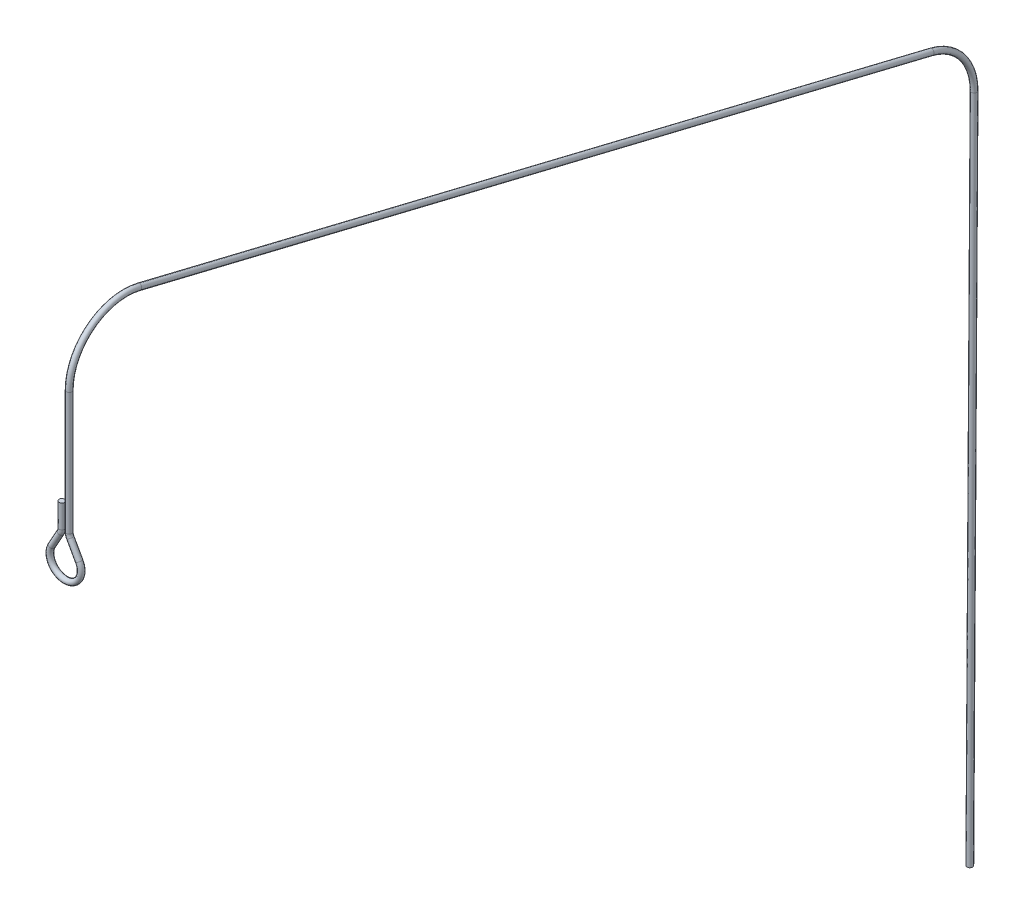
ISO-10303-21;
HEADER;
FILE_DESCRIPTION(('STEP AP214'),'2;1');
FILE_NAME('part.step','',(''),(''),'','','');
FILE_SCHEMA(('AUTOMOTIVE_DESIGN { 1 0 10303 214 1 1 1 1 }'));
ENDSEC;
DATA;
#1=APPLICATION_CONTEXT('core data for automotive mechanical design processes');
#2=APPLICATION_PROTOCOL_DEFINITION('international standard','automotive_design',2000,#1);
#3=PRODUCT_CONTEXT('',#1,'mechanical');
#4=PRODUCT('Part','Part','',(#3));
#5=PRODUCT_RELATED_PRODUCT_CATEGORY('part','',(#4));
#6=PRODUCT_DEFINITION_FORMATION('','',#4);
#7=PRODUCT_DEFINITION_CONTEXT('part definition',#1,'design');
#8=PRODUCT_DEFINITION('design','',#6,#7);
#9=PRODUCT_DEFINITION_SHAPE('','',#8);
#10=(LENGTH_UNIT() NAMED_UNIT(*) SI_UNIT(.MILLI.,.METRE.));
#11=(NAMED_UNIT(*) PLANE_ANGLE_UNIT() SI_UNIT($,.RADIAN.));
#12=(NAMED_UNIT(*) SI_UNIT($,.STERADIAN.) SOLID_ANGLE_UNIT());
#13=UNCERTAINTY_MEASURE_WITH_UNIT(LENGTH_MEASURE(1.E-05),#10,'distance_accuracy_value','');
#14=(GEOMETRIC_REPRESENTATION_CONTEXT(3) GLOBAL_UNCERTAINTY_ASSIGNED_CONTEXT((#13)) GLOBAL_UNIT_ASSIGNED_CONTEXT((#10,
#11,#12)) REPRESENTATION_CONTEXT('',''));
#15=CARTESIAN_POINT('',(0.,0.,0.));
#16=DIRECTION('',(0.,0.,1.));
#17=DIRECTION('',(1.,0.,0.));
#18=AXIS2_PLACEMENT_3D('',#15,#16,#17);
#19=CARTESIAN_POINT('',(0.,1960.39642575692,-7.81948440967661));
#20=DIRECTION('',(0.,-0.999979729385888,0.00636716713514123));
#21=DIRECTION('',(0.,-0.00636716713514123,-0.999979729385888));
#22=AXIS2_PLACEMENT_3D('',#19,#20,#21);
#23=CYLINDRICAL_SURFACE('',#22,2.5);
#24=CARTESIAN_POINT('',(0.,1960.39642575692,-7.81948440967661));
#25=DIRECTION('',(0.,-0.999979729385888,0.00636716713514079));
#26=DIRECTION('',(0.,-0.00636716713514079,-0.999979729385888));
#27=AXIS2_PLACEMENT_3D('',#24,#25,#26);
#28=CIRCLE('',#27,2.5);
#29=CARTESIAN_POINT('',(0.,1960.38050783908,-10.3194337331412));
#30=VERTEX_POINT('',#29);
#31=EDGE_CURVE('E37',#30,#30,#28,.T.);
#32=ORIENTED_EDGE('',*,*,#31,.T.);
#33=EDGE_LOOP('',(#32));
#34=FACE_BOUND('',#33,.T.);
#35=CARTESIAN_POINT('',(0.,1360.39642575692,-3.9991066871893));
#36=DIRECTION('',(0.,-0.999979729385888,0.00636716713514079));
#37=DIRECTION('',(0.,-0.00636716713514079,-0.999979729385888));
#38=AXIS2_PLACEMENT_3D('',#35,#36,#37);
#39=CIRCLE('',#38,2.5);
#40=CARTESIAN_POINT('',(0.,1360.38050783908,-6.49905601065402));
#41=VERTEX_POINT('',#40);
#42=EDGE_CURVE('E10',#41,#41,#39,.T.);
#43=ORIENTED_EDGE('',*,*,#42,.F.);
#44=EDGE_LOOP('',(#43));
#45=FACE_BOUND('',#44,.T.);
#46=ADVANCED_FACE('F31',(#34,#45),#23,.T.);
#47=CARTESIAN_POINT('',(0.,1960.71796769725,42.6794919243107));
#48=DIRECTION('',(-1.,0.,0.));
#49=DIRECTION('',(0.,0.,1.));
#50=AXIS2_PLACEMENT_3D('',#47,#48,#49);
#51=TOROIDAL_SURFACE('',#50,50.4999999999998,2.5);
#52=CARTESIAN_POINT('',(0.,2009.78698008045,30.7429085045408));
#53=DIRECTION('',(0.,-0.2363679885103,-0.971663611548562));
#54=DIRECTION('',(0.,0.971663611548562,-0.2363679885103));
#55=AXIS2_PLACEMENT_3D('',#52,#53,#54);
#56=CIRCLE('',#55,2.5);
#57=CARTESIAN_POINT('',(0.,2012.21613910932,30.151988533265));
#58=VERTEX_POINT('',#57);
#59=EDGE_CURVE('E41',#58,#58,#56,.T.);
#60=CARTESIAN_POINT('',(0.,1960.71796769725,42.6794919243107));
#61=DIRECTION('',(-1.,0.,0.));
#62=DIRECTION('',(0.,0.,1.));
#63=AXIS2_PLACEMENT_3D('',#60,#61,#62);
#64=CIRCLE('',#63,52.9999999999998);
#65=EDGE_CURVE('',#58,#30,#64,.T.);
#66=ORIENTED_EDGE('',*,*,#59,.T.);
#67=ORIENTED_EDGE('',*,*,#31,.F.);
#68=ORIENTED_EDGE('',*,*,#65,.T.);
#69=ORIENTED_EDGE('',*,*,#65,.F.);
#70=EDGE_LOOP('',(#66,#68,#67,#69));
#71=FACE_BOUND('',#70,.T.);
#72=ADVANCED_FACE('F120',(#71),#51,.T.);
#73=CARTESIAN_POINT('',(0.,2182.68063146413,741.475655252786));
#74=DIRECTION('',(0.,-0.2363679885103,-0.971663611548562));
#75=DIRECTION('',(0.,0.971663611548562,-0.2363679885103));
#76=AXIS2_PLACEMENT_3D('',#73,#74,#75);
#77=CYLINDRICAL_SURFACE('',#76,2.5);
#78=CARTESIAN_POINT('',(0.,2182.68063146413,741.475655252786));
#79=DIRECTION('',(0.,-0.2363679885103,-0.971663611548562));
#80=DIRECTION('',(0.,0.971663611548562,-0.2363679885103));
#81=AXIS2_PLACEMENT_3D('',#78,#79,#80);
#82=CIRCLE('',#81,2.5);
#83=CARTESIAN_POINT('',(0.,2185.109790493,740.88473528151));
#84=VERTEX_POINT('',#83);
#85=EDGE_CURVE('E45',#84,#84,#82,.T.);
#86=CARTESIAN_POINT('',(0.,2185.109790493,740.88473528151));
#87=CARTESIAN_POINT('',(0.,2183.30881495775,733.481269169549));
#88=CARTESIAN_POINT('',(0.,2181.5078394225,726.077803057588));
#89=CARTESIAN_POINT('',(0.,2177.90588835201,711.270870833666));
#90=CARTESIAN_POINT('',(0.,2176.10491281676,703.867404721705));
#91=CARTESIAN_POINT('',(0.,2172.50296174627,689.060472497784));
#92=CARTESIAN_POINT('',(0.,2170.70198621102,681.657006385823));
#93=CARTESIAN_POINT('',(0.,2167.10003514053,666.850074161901));
#94=CARTESIAN_POINT('',(0.,2165.29905960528,659.44660804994));
#95=CARTESIAN_POINT('',(0.,2161.69710853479,644.639675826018));
#96=CARTESIAN_POINT('',(0.,2159.89613299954,637.236209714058));
#97=CARTESIAN_POINT('',(0.,2156.29418192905,622.429277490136));
#98=CARTESIAN_POINT('',(0.,2154.4932063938,615.025811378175));
#99=CARTESIAN_POINT('',(0.,2150.89125532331,600.218879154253));
#100=CARTESIAN_POINT('',(0.,2149.09027978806,592.815413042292));
#101=CARTESIAN_POINT('',(0.,2145.48832871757,578.008480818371));
#102=CARTESIAN_POINT('',(0.,2143.68735318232,570.60501470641));
#103=CARTESIAN_POINT('',(0.,2140.08540211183,555.798082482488));
#104=CARTESIAN_POINT('',(0.,2138.28442657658,548.394616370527));
#105=CARTESIAN_POINT('',(0.,2134.68247550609,533.587684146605));
#106=CARTESIAN_POINT('',(0.,2132.88149997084,526.184218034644));
#107=CARTESIAN_POINT('',(0.,2129.27954890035,511.377285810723));
#108=CARTESIAN_POINT('',(0.,2127.4785733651,503.973819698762));
#109=CARTESIAN_POINT('',(0.,2123.87662229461,489.16688747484));
#110=CARTESIAN_POINT('',(0.,2122.07564675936,481.763421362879));
#111=CARTESIAN_POINT('',(0.,2118.47369568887,466.956489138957));
#112=CARTESIAN_POINT('',(0.,2116.67272015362,459.553023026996));
#113=CARTESIAN_POINT('',(0.,2113.07076908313,444.746090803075));
#114=CARTESIAN_POINT('',(0.,2111.26979354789,437.342624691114));
#115=CARTESIAN_POINT('',(0.,2107.66784247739,422.535692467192));
#116=CARTESIAN_POINT('',(0.,2105.86686694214,415.132226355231));
#117=CARTESIAN_POINT('',(0.,2102.26491587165,400.325294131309));
#118=CARTESIAN_POINT('',(0.,2100.4639403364,392.921828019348));
#119=CARTESIAN_POINT('',(0.,2096.86198926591,378.114895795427));
#120=CARTESIAN_POINT('',(0.,2095.06101373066,370.711429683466));
#121=CARTESIAN_POINT('',(0.,2091.45906266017,355.904497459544));
#122=CARTESIAN_POINT('',(0.,2089.65808712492,348.501031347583));
#123=CARTESIAN_POINT('',(0.,2086.05613605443,333.694099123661));
#124=CARTESIAN_POINT('',(0.,2084.25516051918,326.2906330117));
#125=CARTESIAN_POINT('',(0.,2080.65320944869,311.483700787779));
#126=CARTESIAN_POINT('',(0.,2078.85223391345,304.080234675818));
#127=CARTESIAN_POINT('',(0.,2075.25028284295,289.273302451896));
#128=CARTESIAN_POINT('',(0.,2073.4493073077,281.869836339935));
#129=CARTESIAN_POINT('',(0.,2069.84735623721,267.062904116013));
#130=CARTESIAN_POINT('',(0.,2068.04638070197,259.659438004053));
#131=CARTESIAN_POINT('',(0.,2064.44442963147,244.852505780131));
#132=CARTESIAN_POINT('',(0.,2062.64345409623,237.44903966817));
#133=CARTESIAN_POINT('',(0.,2059.04150302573,222.642107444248));
#134=CARTESIAN_POINT('',(0.,2057.24052749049,215.238641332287));
#135=CARTESIAN_POINT('',(0.,2053.63857641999,200.431709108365));
#136=CARTESIAN_POINT('',(0.,2051.83760088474,193.028242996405));
#137=CARTESIAN_POINT('',(0.,2048.23564981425,178.221310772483));
#138=CARTESIAN_POINT('',(0.,2046.43467427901,170.817844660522));
#139=CARTESIAN_POINT('',(0.,2042.83272320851,156.0109124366));
#140=CARTESIAN_POINT('',(0.,2041.03174767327,148.607446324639));
#141=CARTESIAN_POINT('',(0.,2037.42979660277,133.800514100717));
#142=CARTESIAN_POINT('',(0.,2035.62882106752,126.397047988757));
#143=CARTESIAN_POINT('',(0.,2032.02686999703,111.590115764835));
#144=CARTESIAN_POINT('',(0.,2030.22589446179,104.186649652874));
#145=CARTESIAN_POINT('',(0.,2026.62394339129,89.3797174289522));
#146=CARTESIAN_POINT('',(0.,2024.82296785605,81.9762513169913));
#147=CARTESIAN_POINT('',(0.,2021.22101678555,67.1693190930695));
#148=CARTESIAN_POINT('',(0.,2019.42004125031,59.7658529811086));
#149=CARTESIAN_POINT('',(0.,2015.81809017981,44.9589207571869));
#150=CARTESIAN_POINT('',(0.,2014.01711464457,37.555454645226));
#151=CARTESIAN_POINT('',(0.,2012.21613910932,30.1519885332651));
#152=B_SPLINE_CURVE_WITH_KNOTS('',3,(#86,#87,#88,#89,#90,#91,#92,#93,#94,#95,#96,#97,#98,#99,
#100,#101,#102,#103,#104,#105,#106,#107,#108,#109,#110,#111,#112,#113,#114,#115,#116,#117,#118,
#119,#120,#121,#122,#123,#124,#125,#126,#127,#128,#129,#130,#131,#132,#133,#134,#135,#136,#137,
#138,#139,#140,#141,#142,#143,#144,#145,#146,#147,#148,#149,#150,#151),.UNSPECIFIED.,.F.,.F.,(4,
2,2,2,2,2,2,2,2,2,2,2,2,2,2,2,2,2,2,2,2,2,2,2,2,2,2,2,2,2,2,2,4),(0.,22.8581147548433,
45.7162295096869,68.5743442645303,91.4324590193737,114.290573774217,137.148688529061,
160.006803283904,182.864918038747,205.723032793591,228.581147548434,251.439262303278,
274.297377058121,297.155491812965,320.013606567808,342.871721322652,365.729836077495,
388.587950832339,411.446065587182,434.304180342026,457.162295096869,480.020409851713,
502.878524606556,525.736639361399,548.594754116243,571.452868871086,594.31098362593,
617.169098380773,640.027213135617,662.88532789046,685.743442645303,708.601557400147,
731.45967215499),.UNSPECIFIED.);
#153=EDGE_CURVE('BSEAM124',#84,#58,#152,.T.);
#154=ORIENTED_EDGE('',*,*,#85,.T.);
#155=ORIENTED_EDGE('',*,*,#59,.F.);
#156=ORIENTED_EDGE('',*,*,#153,.T.);
#157=ORIENTED_EDGE('',*,*,#153,.F.);
#158=EDGE_LOOP('',(#154,#156,#155,#157));
#159=FACE_BOUND('',#158,.T.);
#160=ADVANCED_FACE('F124',(#159),#77,.T.);
#161=CARTESIAN_POINT('',(0.,2133.61161908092,753.412238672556));
#162=DIRECTION('',(-1.,0.,0.));
#163=DIRECTION('',(0.,0.,1.));
#164=AXIS2_PLACEMENT_3D('',#161,#162,#163);
#165=TOROIDAL_SURFACE('',#164,50.5000000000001,2.5);
#166=CARTESIAN_POINT('',(0.,2133.61161908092,803.912238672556));
#167=DIRECTION('',(0.,1.,0.));
#168=DIRECTION('',(0.,0.,1.));
#169=AXIS2_PLACEMENT_3D('',#166,#167,#168);
#170=CIRCLE('',#169,2.5);
#171=CARTESIAN_POINT('',(0.,2133.61161908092,806.412238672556));
#172=VERTEX_POINT('',#171);
#173=EDGE_CURVE('E50',#172,#172,#170,.T.);
#174=CARTESIAN_POINT('',(0.,2133.61161908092,753.412238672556));
#175=DIRECTION('',(-1.,0.,0.));
#176=DIRECTION('',(0.,0.,1.));
#177=AXIS2_PLACEMENT_3D('',#174,#175,#176);
#178=CIRCLE('',#177,53.0000000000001);
#179=EDGE_CURVE('',#172,#84,#178,.T.);
#180=ORIENTED_EDGE('',*,*,#173,.T.);
#181=ORIENTED_EDGE('',*,*,#85,.F.);
#182=ORIENTED_EDGE('',*,*,#179,.T.);
#183=ORIENTED_EDGE('',*,*,#179,.F.);
#184=EDGE_LOOP('',(#180,#182,#181,#183));
#185=FACE_BOUND('',#184,.T.);
#186=ADVANCED_FACE('F130',(#185),#165,.T.);
#187=CARTESIAN_POINT('',(0.,2133.61161908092,803.912238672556));
#188=DIRECTION('',(0.,-1.,0.));
#189=DIRECTION('',(0.,0.,-1.));
#190=AXIS2_PLACEMENT_3D('',#187,#188,#189);
#191=CYLINDRICAL_SURFACE('',#190,2.5);
#192=ORIENTED_EDGE('',*,*,#173,.F.);
#193=EDGE_LOOP('',(#192));
#194=FACE_BOUND('',#193,.T.);
#195=CARTESIAN_POINT('',(0.,2023.61161908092,803.912238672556));
#196=DIRECTION('',(0.,1.,0.));
#197=DIRECTION('',(0.,0.,1.));
#198=AXIS2_PLACEMENT_3D('',#195,#196,#197);
#199=CIRCLE('',#198,2.50000000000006);
#200=CARTESIAN_POINT('',(-2.50000000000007,2023.61161908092,803.912238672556));
#201=VERTEX_POINT('',#200);
#202=EDGE_CURVE('E71',#201,#201,#199,.T.);
#203=ORIENTED_EDGE('',*,*,#202,.T.);
#204=EDGE_LOOP('',(#203));
#205=FACE_BOUND('',#204,.T.);
#206=ADVANCED_FACE('F75',(#194,#205),#191,.T.);
#207=CARTESIAN_POINT('',(0.,1360.39642575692,-3.9991066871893));
#208=DIRECTION('',(0.,-0.999979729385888,0.00636716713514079));
#209=DIRECTION('',(0.,-0.00636716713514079,-0.999979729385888));
#210=AXIS2_PLACEMENT_3D('',#207,#208,#209);
#211=PLANE('',#210);
#212=ORIENTED_EDGE('',*,*,#42,.T.);
#213=EDGE_LOOP('',(#212));
#214=FACE_BOUND('',#213,.T.);
#215=ADVANCED_FACE('F111',(#214),#211,.T.);
#216=CARTESIAN_POINT('',(-6.49999999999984,2023.61161908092,803.912238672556));
#217=DIRECTION('',(0.,1.,0.));
#218=DIRECTION('',(0.,0.,1.));
#219=AXIS2_PLACEMENT_3D('',#216,#217,#218);
#220=CYLINDRICAL_SURFACE('',#219,2.50000000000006);
#221=CARTESIAN_POINT('',(-6.49999999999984,2023.61161908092,803.912238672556));
#222=DIRECTION('',(0.,-1.,0.));
#223=DIRECTION('',(0.,0.,1.));
#224=AXIS2_PLACEMENT_3D('',#221,#222,#223);
#225=CIRCLE('',#224,2.50000000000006);
#226=CARTESIAN_POINT('',(-3.9999999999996,2023.61161908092,803.912238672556));
#227=VERTEX_POINT('',#226);
#228=EDGE_CURVE('E56',#227,#227,#225,.T.);
#229=ORIENTED_EDGE('',*,*,#228,.F.);
#230=EDGE_LOOP('',(#229));
#231=FACE_BOUND('',#230,.T.);
#232=CARTESIAN_POINT('',(-6.49999999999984,2044.43767989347,803.912238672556));
#233=DIRECTION('',(0.,-1.,0.));
#234=DIRECTION('',(0.,0.,1.));
#235=AXIS2_PLACEMENT_3D('',#232,#233,#234);
#236=CIRCLE('',#235,2.50000000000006);
#237=CARTESIAN_POINT('',(-6.49999999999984,2044.43767989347,806.412238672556));
#238=VERTEX_POINT('',#237);
#239=EDGE_CURVE('E53',#238,#238,#236,.T.);
#240=ORIENTED_EDGE('',*,*,#239,.T.);
#241=EDGE_LOOP('',(#240));
#242=FACE_BOUND('',#241,.T.);
#243=ADVANCED_FACE('F105',(#231,#242),#220,.T.);
#244=CARTESIAN_POINT('',(-14.5,2023.61161908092,803.912238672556));
#245=DIRECTION('',(0.,0.,1.));
#246=DIRECTION('',(1.,0.,0.));
#247=AXIS2_PLACEMENT_3D('',#244,#245,#246);
#248=TOROIDAL_SURFACE('',#247,8.00000000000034,2.50000000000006);
#249=CARTESIAN_POINT('',(-7.51260033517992,2019.71594893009,803.912238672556));
#250=DIRECTION('',(-0.486958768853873,-0.873424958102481,0.));
#251=DIRECTION('',(0.,0.,1.));
#252=AXIS2_PLACEMENT_3D('',#249,#250,#251);
#253=CIRCLE('',#252,2.50000000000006);
#254=CARTESIAN_POINT('',(-5.32903793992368,2018.49855200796,803.912238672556));
#255=VERTEX_POINT('',#254);
#256=EDGE_CURVE('E59',#255,#255,#253,.T.);
#257=CARTESIAN_POINT('',(-14.5,2023.61161908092,803.912238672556));
#258=DIRECTION('',(0.,0.,1.));
#259=DIRECTION('',(1.,0.,0.));
#260=AXIS2_PLACEMENT_3D('',#257,#258,#259);
#261=CIRCLE('',#260,10.5000000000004);
#262=EDGE_CURVE('',#255,#227,#261,.T.);
#263=ORIENTED_EDGE('',*,*,#256,.F.);
#264=ORIENTED_EDGE('',*,*,#228,.T.);
#265=ORIENTED_EDGE('',*,*,#262,.T.);
#266=ORIENTED_EDGE('',*,*,#262,.F.);
#267=EDGE_LOOP('',(#263,#265,#264,#266));
#268=FACE_BOUND('',#267,.T.);
#269=ADVANCED_FACE('F99',(#268),#248,.T.);
#270=CARTESIAN_POINT('',(-15.4779494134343,2005.42904184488,803.912238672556));
#271=DIRECTION('',(0.48695876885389,0.873424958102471,0.));
#272=DIRECTION('',(-0.873424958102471,0.48695876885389,0.));
#273=AXIS2_PLACEMENT_3D('',#270,#271,#272);
#274=CYLINDRICAL_SURFACE('',#273,2.50000000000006);
#275=CARTESIAN_POINT('',(-15.4779494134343,2005.42904184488,803.912238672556));
#276=DIRECTION('',(-0.486958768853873,-0.873424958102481,0.));
#277=DIRECTION('',(0.,0.,1.));
#278=AXIS2_PLACEMENT_3D('',#275,#276,#277);
#279=CIRCLE('',#278,2.50000000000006);
#280=CARTESIAN_POINT('',(-17.6615118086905,2006.64643876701,803.912238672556));
#281=VERTEX_POINT('',#280);
#282=EDGE_CURVE('E62',#281,#281,#279,.T.);
#283=ORIENTED_EDGE('',*,*,#282,.F.);
#284=EDGE_LOOP('',(#283));
#285=FACE_BOUND('',#284,.T.);
#286=ORIENTED_EDGE('',*,*,#256,.T.);
#287=EDGE_LOOP('',(#286));
#288=FACE_BOUND('',#287,.T.);
#289=ADVANCED_FACE('F93',(#285,#288),#274,.T.);
#290=CARTESIAN_POINT('',(-3.25,1998.61161908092,803.912238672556));
#291=DIRECTION('',(0.,0.,-1.));
#292=DIRECTION('',(-1.,0.,0.));
#293=AXIS2_PLACEMENT_3D('',#290,#291,#292);
#294=TOROIDAL_SURFACE('',#293,13.9999999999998,2.50000000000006);
#295=CARTESIAN_POINT('',(8.97794941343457,2005.42904184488,803.912238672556));
#296=DIRECTION('',(-0.486958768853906,0.873424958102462,0.));
#297=DIRECTION('',(0.,0.,1.));
#298=AXIS2_PLACEMENT_3D('',#295,#296,#297);
#299=CIRCLE('',#298,2.50000000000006);
#300=CARTESIAN_POINT('',(11.1615118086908,2006.64643876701,803.912238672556));
#301=VERTEX_POINT('',#300);
#302=EDGE_CURVE('E65',#301,#301,#299,.T.);
#303=CARTESIAN_POINT('',(-3.25,1998.61161908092,803.912238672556));
#304=DIRECTION('',(0.,0.,-1.));
#305=DIRECTION('',(-1.,0.,0.));
#306=AXIS2_PLACEMENT_3D('',#303,#304,#305);
#307=CIRCLE('',#306,16.4999999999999);
#308=EDGE_CURVE('',#301,#281,#307,.T.);
#309=ORIENTED_EDGE('',*,*,#302,.F.);
#310=ORIENTED_EDGE('',*,*,#282,.T.);
#311=ORIENTED_EDGE('',*,*,#308,.T.);
#312=ORIENTED_EDGE('',*,*,#308,.F.);
#313=EDGE_LOOP('',(#309,#311,#310,#312));
#314=FACE_BOUND('',#313,.T.);
#315=ADVANCED_FACE('F87',(#314),#294,.T.);
#316=CARTESIAN_POINT('',(1.01260033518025,2019.71594893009,803.912238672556));
#317=DIRECTION('',(0.486958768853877,-0.873424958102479,0.));
#318=DIRECTION('',(0.873424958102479,0.486958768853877,0.));
#319=AXIS2_PLACEMENT_3D('',#316,#317,#318);
#320=CYLINDRICAL_SURFACE('',#319,2.50000000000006);
#321=CARTESIAN_POINT('',(1.01260033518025,2019.71594893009,803.912238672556));
#322=DIRECTION('',(-0.486958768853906,0.873424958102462,0.));
#323=DIRECTION('',(0.,0.,1.));
#324=AXIS2_PLACEMENT_3D('',#321,#322,#323);
#325=CIRCLE('',#324,2.50000000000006);
#326=CARTESIAN_POINT('',(-1.17096206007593,2018.49855200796,803.912238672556));
#327=VERTEX_POINT('',#326);
#328=EDGE_CURVE('E68',#327,#327,#325,.T.);
#329=ORIENTED_EDGE('',*,*,#328,.F.);
#330=EDGE_LOOP('',(#329));
#331=FACE_BOUND('',#330,.T.);
#332=ORIENTED_EDGE('',*,*,#302,.T.);
#333=EDGE_LOOP('',(#332));
#334=FACE_BOUND('',#333,.T.);
#335=ADVANCED_FACE('F81',(#331,#334),#320,.T.);
#336=CARTESIAN_POINT('',(8.,2023.61161908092,803.912238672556));
#337=DIRECTION('',(0.,0.,1.));
#338=DIRECTION('',(1.,0.,0.));
#339=AXIS2_PLACEMENT_3D('',#336,#337,#338);
#340=TOROIDAL_SURFACE('',#339,8.00000000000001,2.50000000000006);
#341=CARTESIAN_POINT('',(8.,2023.61161908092,803.912238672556));
#342=DIRECTION('',(0.,0.,1.));
#343=DIRECTION('',(1.,0.,0.));
#344=AXIS2_PLACEMENT_3D('',#341,#342,#343);
#345=CIRCLE('',#344,10.5000000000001);
#346=EDGE_CURVE('',#201,#327,#345,.T.);
#347=ORIENTED_EDGE('',*,*,#202,.F.);
#348=ORIENTED_EDGE('',*,*,#328,.T.);
#349=ORIENTED_EDGE('',*,*,#346,.T.);
#350=ORIENTED_EDGE('',*,*,#346,.F.);
#351=EDGE_LOOP('',(#347,#349,#348,#350));
#352=FACE_BOUND('',#351,.T.);
#353=ADVANCED_FACE('F77',(#352),#340,.T.);
#354=CARTESIAN_POINT('',(-6.49999999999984,2044.43767989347,803.912238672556));
#355=DIRECTION('',(0.,-1.,0.));
#356=DIRECTION('',(0.,0.,1.));
#357=AXIS2_PLACEMENT_3D('',#354,#355,#356);
#358=PLANE('',#357);
#359=ORIENTED_EDGE('',*,*,#239,.F.);
#360=EDGE_LOOP('',(#359));
#361=FACE_BOUND('',#360,.T.);
#362=ADVANCED_FACE('F80',(#361),#358,.F.);
#363=CLOSED_SHELL('',(#46,#72,#160,#186,#206,#215,#243,#269,#289,#315,#335,#353,#362));
#364=MANIFOLD_SOLID_BREP('B2',#363);
#365=ADVANCED_BREP_SHAPE_REPRESENTATION('',(#18,#364),#14);
#366=SHAPE_DEFINITION_REPRESENTATION(#9,#365);
ENDSEC;
END-ISO-10303-21;
